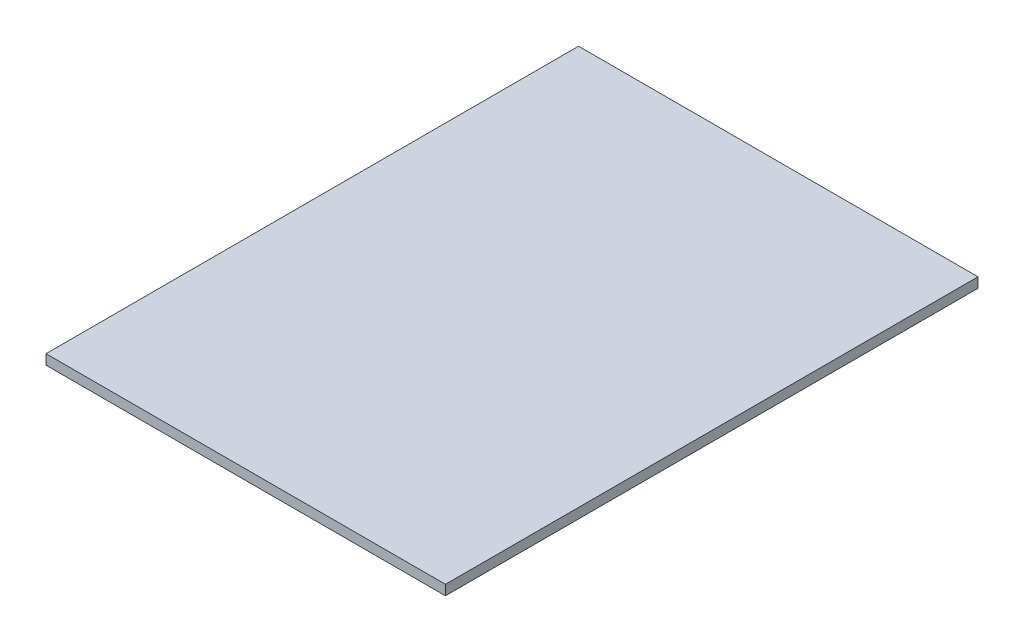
ISO-10303-21;
HEADER;
FILE_DESCRIPTION(('STEP AP214'),'2;1');
FILE_NAME('part.step','',(''),(''),'','','');
FILE_SCHEMA(('AUTOMOTIVE_DESIGN { 1 0 10303 214 1 1 1 1 }'));
ENDSEC;
DATA;
#1=APPLICATION_CONTEXT('core data for automotive mechanical design processes');
#2=APPLICATION_PROTOCOL_DEFINITION('international standard','automotive_design',2000,#1);
#3=PRODUCT_CONTEXT('',#1,'mechanical');
#4=PRODUCT('Part','Part','',(#3));
#5=PRODUCT_RELATED_PRODUCT_CATEGORY('part','',(#4));
#6=PRODUCT_DEFINITION_FORMATION('','',#4);
#7=PRODUCT_DEFINITION_CONTEXT('part definition',#1,'design');
#8=PRODUCT_DEFINITION('design','',#6,#7);
#9=PRODUCT_DEFINITION_SHAPE('','',#8);
#10=(LENGTH_UNIT() NAMED_UNIT(*) SI_UNIT(.MILLI.,.METRE.));
#11=(NAMED_UNIT(*) PLANE_ANGLE_UNIT() SI_UNIT($,.RADIAN.));
#12=(NAMED_UNIT(*) SI_UNIT($,.STERADIAN.) SOLID_ANGLE_UNIT());
#13=UNCERTAINTY_MEASURE_WITH_UNIT(LENGTH_MEASURE(1.E-05),#10,'distance_accuracy_value','');
#14=(GEOMETRIC_REPRESENTATION_CONTEXT(3) GLOBAL_UNCERTAINTY_ASSIGNED_CONTEXT((#13)) GLOBAL_UNIT_ASSIGNED_CONTEXT((#10,
#11,#12)) REPRESENTATION_CONTEXT('',''));
#15=CARTESIAN_POINT('',(0.,0.,0.));
#16=DIRECTION('',(0.,0.,1.));
#17=DIRECTION('',(1.,0.,0.));
#18=AXIS2_PLACEMENT_3D('',#15,#16,#17);
#19=CARTESIAN_POINT('',(0.,76.2,0.));
#20=DIRECTION('',(1.,0.,0.));
#21=DIRECTION('',(0.,0.,-1.));
#22=AXIS2_PLACEMENT_3D('',#19,#20,#21);
#23=PLANE('',#22);
#24=DIRECTION('',(0.,0.,1.));
#25=VECTOR('',#24,1.);
#26=CARTESIAN_POINT('',(0.,0.,0.));
#27=LINE('',#26,#25);
#28=CARTESIAN_POINT('',(0.,0.,-4064.));
#29=VERTEX_POINT('',#28);
#30=CARTESIAN_POINT('',(0.,0.,0.));
#31=VERTEX_POINT('',#30);
#32=EDGE_CURVE('E75',#29,#31,#27,.T.);
#33=ORIENTED_EDGE('',*,*,#32,.T.);
#34=DIRECTION('',(0.,-1.,0.));
#35=VECTOR('',#34,1.);
#36=CARTESIAN_POINT('',(0.,76.2,0.));
#37=LINE('',#36,#35);
#38=CARTESIAN_POINT('',(0.,76.2,0.));
#39=VERTEX_POINT('',#38);
#40=EDGE_CURVE('E11',#39,#31,#37,.T.);
#41=ORIENTED_EDGE('',*,*,#40,.F.);
#42=DIRECTION('',(0.,0.,1.));
#43=VECTOR('',#42,1.);
#44=CARTESIAN_POINT('',(0.,76.2,0.));
#45=LINE('',#44,#43);
#46=CARTESIAN_POINT('',(0.,76.2,-4064.));
#47=VERTEX_POINT('',#46);
#48=EDGE_CURVE('E93',#47,#39,#45,.T.);
#49=ORIENTED_EDGE('',*,*,#48,.F.);
#50=DIRECTION('',(0.,-1.,0.));
#51=VECTOR('',#50,1.);
#52=CARTESIAN_POINT('',(0.,76.2,-4064.));
#53=LINE('',#52,#51);
#54=EDGE_CURVE('E87',#47,#29,#53,.T.);
#55=ORIENTED_EDGE('',*,*,#54,.T.);
#56=EDGE_LOOP('',(#33,#41,#49,#55));
#57=FACE_BOUND('',#56,.T.);
#58=ADVANCED_FACE('F31',(#57),#23,.F.);
#59=CARTESIAN_POINT('',(0.,76.2,0.));
#60=DIRECTION('',(0.,0.,-1.));
#61=DIRECTION('',(-1.,0.,0.));
#62=AXIS2_PLACEMENT_3D('',#59,#60,#61);
#63=PLANE('',#62);
#64=DIRECTION('',(1.,0.,0.));
#65=VECTOR('',#64,1.);
#66=CARTESIAN_POINT('',(0.,0.,0.));
#67=LINE('',#66,#65);
#68=CARTESIAN_POINT('',(3048.,0.,0.));
#69=VERTEX_POINT('',#68);
#70=EDGE_CURVE('E71',#31,#69,#67,.T.);
#71=ORIENTED_EDGE('',*,*,#70,.T.);
#72=DIRECTION('',(0.,-1.,0.));
#73=VECTOR('',#72,1.);
#74=CARTESIAN_POINT('',(3048.,76.2,0.));
#75=LINE('',#74,#73);
#76=CARTESIAN_POINT('',(3048.,76.2,0.));
#77=VERTEX_POINT('',#76);
#78=EDGE_CURVE('E38',#77,#69,#75,.T.);
#79=ORIENTED_EDGE('',*,*,#78,.F.);
#80=DIRECTION('',(1.,0.,0.));
#81=VECTOR('',#80,1.);
#82=CARTESIAN_POINT('',(0.,76.2,0.));
#83=LINE('',#82,#81);
#84=EDGE_CURVE('E83',#39,#77,#83,.T.);
#85=ORIENTED_EDGE('',*,*,#84,.F.);
#86=ORIENTED_EDGE('',*,*,#40,.T.);
#87=EDGE_LOOP('',(#71,#79,#85,#86));
#88=FACE_BOUND('',#87,.T.);
#89=ADVANCED_FACE('F82',(#88),#63,.F.);
#90=CARTESIAN_POINT('',(3048.,76.2,0.));
#91=DIRECTION('',(-1.,0.,0.));
#92=DIRECTION('',(0.,0.,1.));
#93=AXIS2_PLACEMENT_3D('',#90,#91,#92);
#94=PLANE('',#93);
#95=DIRECTION('',(0.,0.,-1.));
#96=VECTOR('',#95,1.);
#97=CARTESIAN_POINT('',(3048.,0.,0.));
#98=LINE('',#97,#96);
#99=CARTESIAN_POINT('',(3048.,0.,-4064.));
#100=VERTEX_POINT('',#99);
#101=EDGE_CURVE('E76',#69,#100,#98,.T.);
#102=ORIENTED_EDGE('',*,*,#101,.T.);
#103=DIRECTION('',(0.,-1.,0.));
#104=VECTOR('',#103,1.);
#105=CARTESIAN_POINT('',(3048.,76.2,-4064.));
#106=LINE('',#105,#104);
#107=CARTESIAN_POINT('',(3048.,76.2,-4064.));
#108=VERTEX_POINT('',#107);
#109=EDGE_CURVE('E99',#108,#100,#106,.T.);
#110=ORIENTED_EDGE('',*,*,#109,.F.);
#111=DIRECTION('',(0.,0.,-1.));
#112=VECTOR('',#111,1.);
#113=CARTESIAN_POINT('',(3048.,76.2,0.));
#114=LINE('',#113,#112);
#115=EDGE_CURVE('E50',#77,#108,#114,.T.);
#116=ORIENTED_EDGE('',*,*,#115,.F.);
#117=ORIENTED_EDGE('',*,*,#78,.T.);
#118=EDGE_LOOP('',(#102,#110,#116,#117));
#119=FACE_BOUND('',#118,.T.);
#120=ADVANCED_FACE('F102',(#119),#94,.F.);
#121=CARTESIAN_POINT('',(0.,76.2,-4064.));
#122=DIRECTION('',(0.,0.,1.));
#123=DIRECTION('',(1.,0.,0.));
#124=AXIS2_PLACEMENT_3D('',#121,#122,#123);
#125=PLANE('',#124);
#126=DIRECTION('',(-1.,0.,0.));
#127=VECTOR('',#126,1.);
#128=CARTESIAN_POINT('',(0.,0.,-4064.));
#129=LINE('',#128,#127);
#130=EDGE_CURVE('E91',#100,#29,#129,.T.);
#131=ORIENTED_EDGE('',*,*,#130,.T.);
#132=ORIENTED_EDGE('',*,*,#54,.F.);
#133=DIRECTION('',(-1.,0.,0.));
#134=VECTOR('',#133,1.);
#135=CARTESIAN_POINT('',(0.,76.2,-4064.));
#136=LINE('',#135,#134);
#137=EDGE_CURVE('E45',#108,#47,#136,.T.);
#138=ORIENTED_EDGE('',*,*,#137,.F.);
#139=ORIENTED_EDGE('',*,*,#109,.T.);
#140=EDGE_LOOP('',(#131,#132,#138,#139));
#141=FACE_BOUND('',#140,.T.);
#142=ADVANCED_FACE('F104',(#141),#125,.F.);
#143=CARTESIAN_POINT('',(0.,76.2,-4064.));
#144=DIRECTION('',(0.,-1.,0.));
#145=DIRECTION('',(0.,0.,-1.));
#146=AXIS2_PLACEMENT_3D('',#143,#144,#145);
#147=PLANE('',#146);
#148=ORIENTED_EDGE('',*,*,#48,.T.);
#149=ORIENTED_EDGE('',*,*,#84,.T.);
#150=ORIENTED_EDGE('',*,*,#115,.T.);
#151=ORIENTED_EDGE('',*,*,#137,.T.);
#152=EDGE_LOOP('',(#148,#149,#150,#151));
#153=FACE_BOUND('',#152,.T.);
#154=ADVANCED_FACE('F105',(#153),#147,.F.);
#155=CARTESIAN_POINT('',(0.,0.,-4064.));
#156=DIRECTION('',(0.,-1.,0.));
#157=DIRECTION('',(0.,0.,-1.));
#158=AXIS2_PLACEMENT_3D('',#155,#156,#157);
#159=PLANE('',#158);
#160=ORIENTED_EDGE('',*,*,#32,.F.);
#161=ORIENTED_EDGE('',*,*,#130,.F.);
#162=ORIENTED_EDGE('',*,*,#101,.F.);
#163=ORIENTED_EDGE('',*,*,#70,.F.);
#164=EDGE_LOOP('',(#160,#161,#162,#163));
#165=FACE_BOUND('',#164,.T.);
#166=ADVANCED_FACE('F72',(#165),#159,.T.);
#167=CLOSED_SHELL('',(#58,#89,#120,#142,#154,#166));
#168=MANIFOLD_SOLID_BREP('B2',#167);
#169=ADVANCED_BREP_SHAPE_REPRESENTATION('',(#18,#168),#14);
#170=SHAPE_DEFINITION_REPRESENTATION(#9,#169);
ENDSEC;
END-ISO-10303-21;
